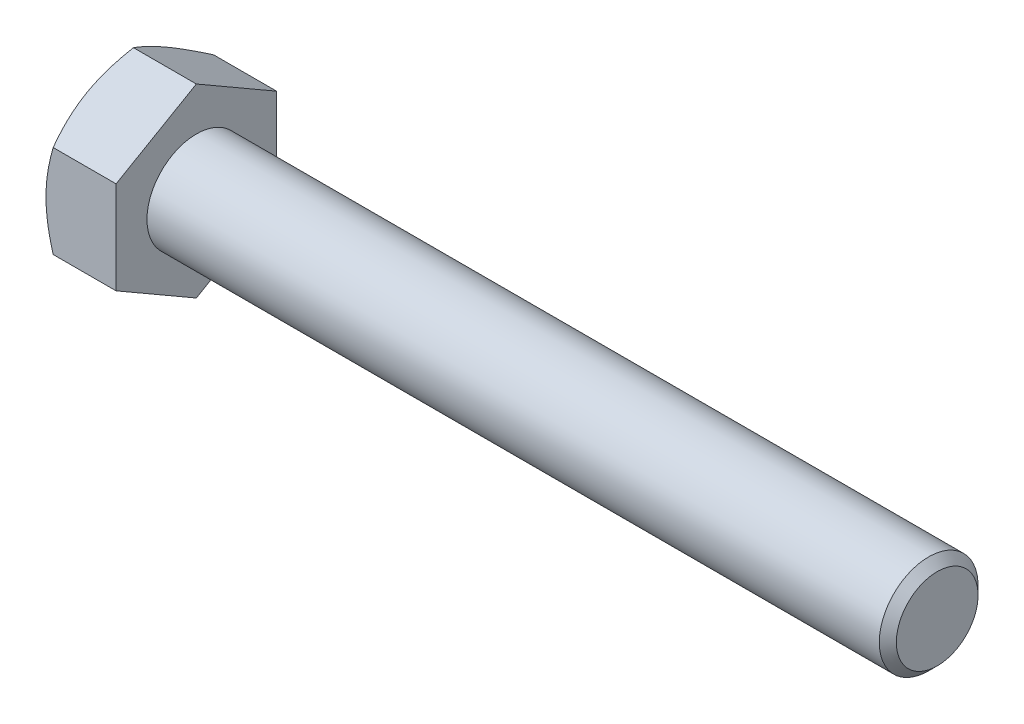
from build123d import *

# Parameters (mm, degrees)
BASEHEAD_DEPTH = 5.675


with BuildPart() as part:
    # Sketch1 → BaseHead (new body)
    with BuildSketch(Plane(origin=(0, 0, 0), x_dir=(0, 0, -1), z_dir=(1, 0, 0))):
        Polygon((6.5, 3.75277675), (6.5, -3.75277675), (0, -7.505553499), (-6.5, -3.75277675), (-6.5, 3.75277675), (0, 7.505553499), align=None)
    extrude(amount=BASEHEAD_DEPTH)

    # BodySke → BaseBody (revolve)
    with BuildSketch(Plane.XY, mode=Mode.PRIVATE) as basebody_sk:
        Polygon((0, 0), (65.675, 0), (65.675, 3.3095), (64.9845, 4), (0, 4), align=None)
    revolve(basebody_sk.sketch.rotate(Axis((0, 0, 0), (1, 0, 0)), 90), axis=Axis((0, 0, 0), (1, 0, 0)))

    # Sketch3 → HeadChamfer (revolve, cut)
    with BuildSketch(Plane.XY):
        Polygon((0, 6.5), (3.46730793, 12.505553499), (3.46730793, 17.505553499), (-10, 17.505553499), (-10, 6.5), align=None)
    revolve(axis=Axis((0, 0, 0), (1, 0, 0)), mode=Mode.SUBTRACT)


solid = part.part
